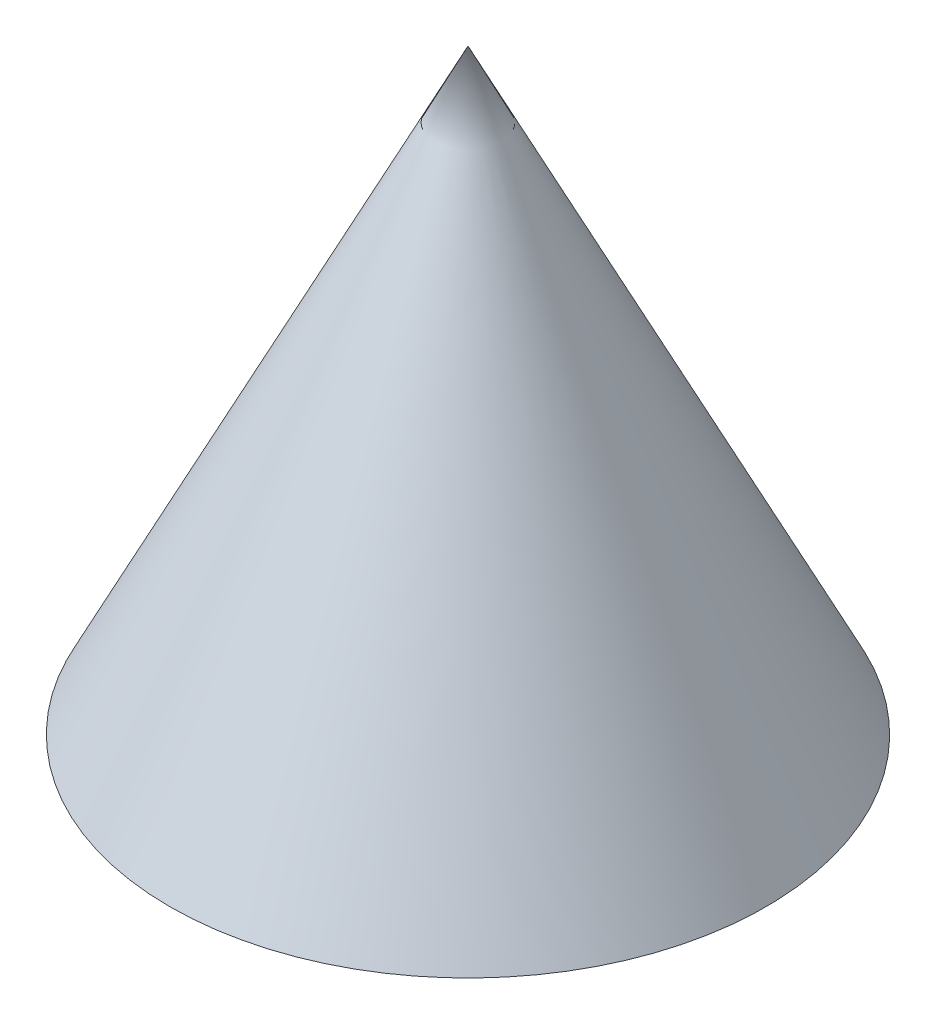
ISO-10303-21;
HEADER;
FILE_DESCRIPTION(('STEP AP214'),'2;1');
FILE_NAME('part.step','',(''),(''),'','','');
FILE_SCHEMA(('AUTOMOTIVE_DESIGN { 1 0 10303 214 1 1 1 1 }'));
ENDSEC;
DATA;
#1=APPLICATION_CONTEXT('core data for automotive mechanical design processes');
#2=APPLICATION_PROTOCOL_DEFINITION('international standard','automotive_design',2000,#1);
#3=PRODUCT_CONTEXT('',#1,'mechanical');
#4=PRODUCT('Part','Part','',(#3));
#5=PRODUCT_RELATED_PRODUCT_CATEGORY('part','',(#4));
#6=PRODUCT_DEFINITION_FORMATION('','',#4);
#7=PRODUCT_DEFINITION_CONTEXT('part definition',#1,'design');
#8=PRODUCT_DEFINITION('design','',#6,#7);
#9=PRODUCT_DEFINITION_SHAPE('','',#8);
#10=(LENGTH_UNIT() NAMED_UNIT(*) SI_UNIT(.MILLI.,.METRE.));
#11=(NAMED_UNIT(*) PLANE_ANGLE_UNIT() SI_UNIT($,.RADIAN.));
#12=(NAMED_UNIT(*) SI_UNIT($,.STERADIAN.) SOLID_ANGLE_UNIT());
#13=UNCERTAINTY_MEASURE_WITH_UNIT(LENGTH_MEASURE(1.E-05),#10,'distance_accuracy_value','');
#14=(GEOMETRIC_REPRESENTATION_CONTEXT(3) GLOBAL_UNCERTAINTY_ASSIGNED_CONTEXT((#13)) GLOBAL_UNIT_ASSIGNED_CONTEXT((#10,
#11,#12)) REPRESENTATION_CONTEXT('',''));
#15=CARTESIAN_POINT('',(0.,0.,0.));
#16=DIRECTION('',(0.,0.,1.));
#17=DIRECTION('',(1.,0.,0.));
#18=AXIS2_PLACEMENT_3D('',#15,#16,#17);
#19=CARTESIAN_POINT('',(0.,0.,0.));
#20=DIRECTION('',(0.,1.,0.));
#21=DIRECTION('',(0.,0.,1.));
#22=AXIS2_PLACEMENT_3D('',#19,#20,#21);
#23=PLANE('',#22);
#24=CARTESIAN_POINT('',(0.,0.,0.));
#25=DIRECTION('',(0.,1.,0.));
#26=DIRECTION('',(0.,0.,1.));
#27=AXIS2_PLACEMENT_3D('',#24,#25,#26);
#28=CIRCLE('',#27,40.);
#29=CARTESIAN_POINT('',(0.,0.,40.));
#30=VERTEX_POINT('',#29);
#31=EDGE_CURVE('E12',#30,#30,#28,.T.);
#32=ORIENTED_EDGE('',*,*,#31,.F.);
#33=EDGE_LOOP('',(#32));
#34=FACE_BOUND('',#33,.T.);
#35=ADVANCED_FACE('F48',(#34),#23,.F.);
#36=CARTESIAN_POINT('',(0.,80.,0.));
#37=DIRECTION('',(0.,-1.,0.));
#38=DIRECTION('',(0.,0.,-1.));
#39=AXIS2_PLACEMENT_3D('',#36,#37,#38);
#40=CONICAL_SURFACE('',#39,0.,0.463647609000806);
#41=ORIENTED_EDGE('',*,*,#31,.T.);
#42=EDGE_LOOP('',(#41));
#43=FACE_BOUND('',#42,.T.);
#44=CARTESIAN_POINT('',(0.,80.,0.));
#45=VERTEX_POINT('',#44);
#46=VERTEX_LOOP('',#45);
#47=FACE_BOUND('',#46,.T.);
#48=ADVANCED_FACE('F50',(#43,#47),#40,.T.);
#49=CLOSED_SHELL('',(#35,#48));
#50=MANIFOLD_SOLID_BREP('B2',#49);
#51=ADVANCED_BREP_SHAPE_REPRESENTATION('',(#18,#50),#14);
#52=SHAPE_DEFINITION_REPRESENTATION(#9,#51);
ENDSEC;
END-ISO-10303-21;
